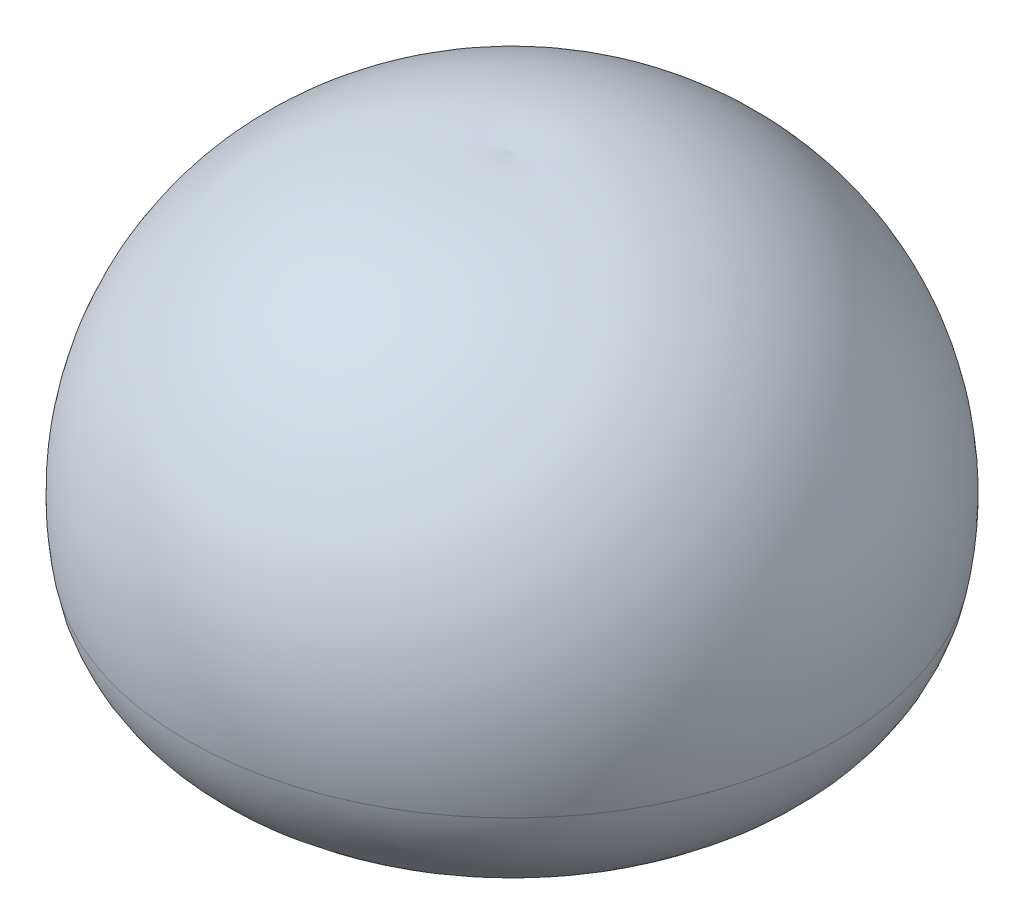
ISO-10303-21;
HEADER;
FILE_DESCRIPTION(('STEP AP214'),'2;1');
FILE_NAME('part.step','',(''),(''),'','','');
FILE_SCHEMA(('AUTOMOTIVE_DESIGN { 1 0 10303 214 1 1 1 1 }'));
ENDSEC;
DATA;
#1=APPLICATION_CONTEXT('core data for automotive mechanical design processes');
#2=APPLICATION_PROTOCOL_DEFINITION('international standard','automotive_design',2000,#1);
#3=PRODUCT_CONTEXT('',#1,'mechanical');
#4=PRODUCT('Part','Part','',(#3));
#5=PRODUCT_RELATED_PRODUCT_CATEGORY('part','',(#4));
#6=PRODUCT_DEFINITION_FORMATION('','',#4);
#7=PRODUCT_DEFINITION_CONTEXT('part definition',#1,'design');
#8=PRODUCT_DEFINITION('design','',#6,#7);
#9=PRODUCT_DEFINITION_SHAPE('','',#8);
#10=(LENGTH_UNIT() NAMED_UNIT(*) SI_UNIT(.MILLI.,.METRE.));
#11=(NAMED_UNIT(*) PLANE_ANGLE_UNIT() SI_UNIT($,.RADIAN.));
#12=(NAMED_UNIT(*) SI_UNIT($,.STERADIAN.) SOLID_ANGLE_UNIT());
#13=UNCERTAINTY_MEASURE_WITH_UNIT(LENGTH_MEASURE(1.E-05),#10,'distance_accuracy_value','');
#14=(GEOMETRIC_REPRESENTATION_CONTEXT(3) GLOBAL_UNCERTAINTY_ASSIGNED_CONTEXT((#13)) GLOBAL_UNIT_ASSIGNED_CONTEXT((#10,
#11,#12)) REPRESENTATION_CONTEXT('',''));
#15=CARTESIAN_POINT('',(0.,0.,0.));
#16=DIRECTION('',(0.,0.,1.));
#17=DIRECTION('',(1.,0.,0.));
#18=AXIS2_PLACEMENT_3D('',#15,#16,#17);
#19=CARTESIAN_POINT('',(0.,610.5,-250.));
#20=DIRECTION('',(-1.,0.,0.));
#21=DIRECTION('',(0.,0.,-1.));
#22=AXIS2_PLACEMENT_3D('',#19,#20,#21);
#23=CIRCLE('',#22,2304.76385208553);
#24=TRIMMED_CURVE('',#23,(PARAMETER_VALUE(-1.6794811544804)),(PARAMETER_VALUE(1.6794811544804)),
.T.,.PARAMETER.);
#25=CARTESIAN_POINT('',(0.,610.5,0.));
#26=DIRECTION('',(0.,-1.,0.));
#27=AXIS1_PLACEMENT('',#25,#26);
#28=SURFACE_OF_REVOLUTION('',#24,#27);
#29=CARTESIAN_POINT('',(0.,2901.66485960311,0.));
#30=VERTEX_POINT('',#29);
#31=VERTEX_LOOP('',#30);
#32=FACE_BOUND('',#31,.T.);
#33=CARTESIAN_POINT('',(0.,210.281957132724,0.));
#34=DIRECTION('',(0.,-1.,0.));
#35=DIRECTION('',(0.,0.,-1.));
#36=AXIS2_PLACEMENT_3D('',#33,#34,#35);
#37=CIRCLE('',#36,2519.74931039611);
#38=CARTESIAN_POINT('',(0.,210.281957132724,-2519.74931039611));
#39=VERTEX_POINT('',#38);
#40=EDGE_CURVE('E51',#39,#39,#37,.T.);
#41=ORIENTED_EDGE('',*,*,#40,.F.);
#42=EDGE_LOOP('',(#41));
#43=FACE_BOUND('',#42,.T.);
#44=ADVANCED_FACE('F33',(#32,#43),#28,.T.);
#45=CARTESIAN_POINT('',(0.,407.331632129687,902.225071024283));
#46=DIRECTION('',(-1.,0.,0.));
#47=DIRECTION('',(0.,0.,-1.));
#48=AXIS2_PLACEMENT_3D('',#45,#46,#47);
#49=CIRCLE('',#48,1134.76385208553);
#50=TRIMMED_CURVE('',#49,(PARAMETER_VALUE(-0.651661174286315)),
(PARAMETER_VALUE(0.651661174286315)),.T.,.PARAMETER.);
#51=CARTESIAN_POINT('',(0.,407.331632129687,0.));
#52=DIRECTION('',(0.,-1.,0.));
#53=AXIS1_PLACEMENT('',#51,#52);
#54=SURFACE_OF_REVOLUTION('',#50,#53);
#55=CARTESIAN_POINT('',(0.,1060.65778790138,0.));
#56=DIRECTION('',(0.,-1.,0.));
#57=DIRECTION('',(0.,0.,-1.));
#58=AXIS2_PLACEMENT_3D('',#55,#56,#57);
#59=CIRCLE('',#58,25.5970747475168);
#60=CARTESIAN_POINT('',(0.,1060.65778790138,-25.5970747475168));
#61=VERTEX_POINT('',#60);
#62=EDGE_CURVE('E11',#61,#61,#59,.T.);
#63=ORIENTED_EDGE('',*,*,#62,.T.);
#64=EDGE_LOOP('',(#63));
#65=FACE_BOUND('',#64,.T.);
#66=CARTESIAN_POINT('',(0.,1095.57499113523,0.));
#67=VERTEX_POINT('',#66);
#68=VERTEX_LOOP('',#67);
#69=FACE_BOUND('',#68,.T.);
#70=ADVANCED_FACE('F48',(#65,#69),#54,.F.);
#71=CARTESIAN_POINT('',(0.,610.5,0.));
#72=DIRECTION('',(0.,-1.,0.));
#73=DIRECTION('',(0.,0.,-1.));
#74=AXIS2_PLACEMENT_3D('',#71,#72,#73);
#75=DEGENERATE_TOROIDAL_SURFACE('',#74,250.,502.989768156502,.T.);
#76=CARTESIAN_POINT('',(0.,110.739727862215,0.));
#77=DIRECTION('',(0.,-1.,0.));
#78=DIRECTION('',(0.,0.,-1.));
#79=AXIS2_PLACEMENT_3D('',#76,#77,#78);
#80=CIRCLE('',#79,306.906741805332);
#81=CARTESIAN_POINT('',(0.,110.739727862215,-306.906741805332));
#82=VERTEX_POINT('',#81);
#83=EDGE_CURVE('E40',#82,#82,#80,.T.);
#84=ORIENTED_EDGE('',*,*,#83,.T.);
#85=EDGE_LOOP('',(#84));
#86=FACE_BOUND('',#85,.T.);
#87=ORIENTED_EDGE('',*,*,#62,.F.);
#88=EDGE_LOOP('',(#87));
#89=FACE_BOUND('',#88,.T.);
#90=ADVANCED_FACE('F57',(#86,#89),#75,.F.);
#91=CARTESIAN_POINT('',(0.,407.331632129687,0.));
#92=DIRECTION('',(0.,-1.,0.));
#93=DIRECTION('',(0.,0.,-1.));
#94=AXIS2_PLACEMENT_3D('',#91,#92,#93);
#95=TOROIDAL_SURFACE('',#94,1402.22507102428,1134.76385208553);
#96=ORIENTED_EDGE('',*,*,#40,.T.);
#97=EDGE_LOOP('',(#96));
#98=FACE_BOUND('',#97,.T.);
#99=ORIENTED_EDGE('',*,*,#83,.F.);
#100=EDGE_LOOP('',(#99));
#101=FACE_BOUND('',#100,.T.);
#102=ADVANCED_FACE('F60',(#98,#101),#95,.T.);
#103=CLOSED_SHELL('',(#44,#70,#90,#102));
#104=MANIFOLD_SOLID_BREP('B2',#103);
#105=ADVANCED_BREP_SHAPE_REPRESENTATION('',(#18,#104),#14);
#106=SHAPE_DEFINITION_REPRESENTATION(#9,#105);
ENDSEC;
END-ISO-10303-21;
